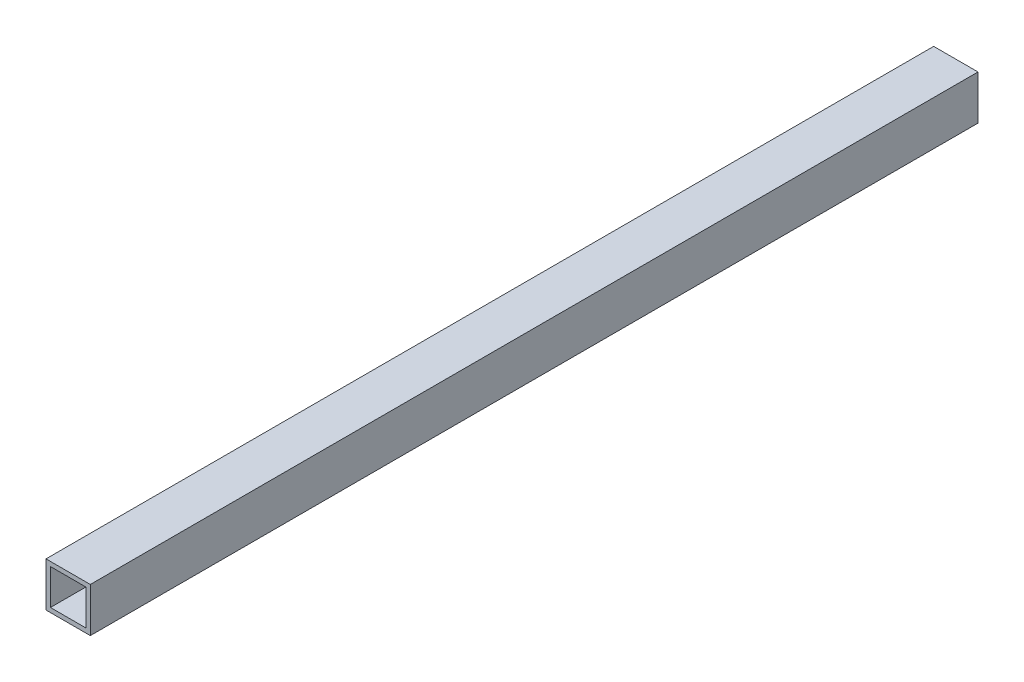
ISO-10303-21;
HEADER;
FILE_DESCRIPTION(('STEP AP214'),'2;1');
FILE_NAME('part.step','',(''),(''),'','','');
FILE_SCHEMA(('AUTOMOTIVE_DESIGN { 1 0 10303 214 1 1 1 1 }'));
ENDSEC;
DATA;
#1=APPLICATION_CONTEXT('core data for automotive mechanical design processes');
#2=APPLICATION_PROTOCOL_DEFINITION('international standard','automotive_design',2000,#1);
#3=PRODUCT_CONTEXT('',#1,'mechanical');
#4=PRODUCT('Part','Part','',(#3));
#5=PRODUCT_RELATED_PRODUCT_CATEGORY('part','',(#4));
#6=PRODUCT_DEFINITION_FORMATION('','',#4);
#7=PRODUCT_DEFINITION_CONTEXT('part definition',#1,'design');
#8=PRODUCT_DEFINITION('design','',#6,#7);
#9=PRODUCT_DEFINITION_SHAPE('','',#8);
#10=(LENGTH_UNIT() NAMED_UNIT(*) SI_UNIT(.MILLI.,.METRE.));
#11=(NAMED_UNIT(*) PLANE_ANGLE_UNIT() SI_UNIT($,.RADIAN.));
#12=(NAMED_UNIT(*) SI_UNIT($,.STERADIAN.) SOLID_ANGLE_UNIT());
#13=UNCERTAINTY_MEASURE_WITH_UNIT(LENGTH_MEASURE(1.E-05),#10,'distance_accuracy_value','');
#14=(GEOMETRIC_REPRESENTATION_CONTEXT(3) GLOBAL_UNCERTAINTY_ASSIGNED_CONTEXT((#13)) GLOBAL_UNIT_ASSIGNED_CONTEXT((#10,
#11,#12)) REPRESENTATION_CONTEXT('',''));
#15=CARTESIAN_POINT('',(0.,0.,0.));
#16=DIRECTION('',(0.,0.,1.));
#17=DIRECTION('',(1.,0.,0.));
#18=AXIS2_PLACEMENT_3D('',#15,#16,#17);
#19=CARTESIAN_POINT('',(0.,0.,200.25));
#20=DIRECTION('',(0.,0.,1.));
#21=DIRECTION('',(1.,0.,0.));
#22=AXIS2_PLACEMENT_3D('',#19,#20,#21);
#23=PLANE('',#22);
#24=DIRECTION('',(0.,-1.,0.));
#25=VECTOR('',#24,1.);
#26=CARTESIAN_POINT('',(-4.91938651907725,6.2171488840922,200.25));
#27=LINE('',#26,#25);
#28=CARTESIAN_POINT('',(-4.91938651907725,6.2171488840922,200.25));
#29=VERTEX_POINT('',#28);
#30=CARTESIAN_POINT('',(-4.91938651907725,-3.78285111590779,200.25));
#31=VERTEX_POINT('',#30);
#32=EDGE_CURVE('E135',#29,#31,#27,.T.);
#33=ORIENTED_EDGE('',*,*,#32,.T.);
#34=DIRECTION('',(1.,0.,0.));
#35=VECTOR('',#34,1.);
#36=CARTESIAN_POINT('',(-4.91938651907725,-3.78285111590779,200.25));
#37=LINE('',#36,#35);
#38=CARTESIAN_POINT('',(5.08061348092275,-3.78285111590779,200.25));
#39=VERTEX_POINT('',#38);
#40=EDGE_CURVE('E138',#31,#39,#37,.T.);
#41=ORIENTED_EDGE('',*,*,#40,.T.);
#42=DIRECTION('',(0.,1.,0.));
#43=VECTOR('',#42,1.);
#44=CARTESIAN_POINT('',(5.08061348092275,6.2171488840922,200.25));
#45=LINE('',#44,#43);
#46=CARTESIAN_POINT('',(5.08061348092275,6.2171488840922,200.25));
#47=VERTEX_POINT('',#46);
#48=EDGE_CURVE('E141',#39,#47,#45,.T.);
#49=ORIENTED_EDGE('',*,*,#48,.T.);
#50=DIRECTION('',(-1.,0.,0.));
#51=VECTOR('',#50,1.);
#52=CARTESIAN_POINT('',(-4.91938651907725,6.2171488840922,200.25));
#53=LINE('',#52,#51);
#54=EDGE_CURVE('E143',#47,#29,#53,.T.);
#55=ORIENTED_EDGE('',*,*,#54,.T.);
#56=EDGE_LOOP('',(#33,#41,#49,#55));
#57=FACE_BOUND('',#56,.T.);
#58=DIRECTION('',(1.,0.,0.));
#59=VECTOR('',#58,1.);
#60=CARTESIAN_POINT('',(4.08061348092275,-2.7828511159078,200.25));
#61=LINE('',#60,#59);
#62=CARTESIAN_POINT('',(-3.91938651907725,-2.7828511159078,200.25));
#63=VERTEX_POINT('',#62);
#64=CARTESIAN_POINT('',(4.08061348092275,-2.7828511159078,200.25));
#65=VERTEX_POINT('',#64);
#66=EDGE_CURVE('E107',#63,#65,#61,.T.);
#67=ORIENTED_EDGE('',*,*,#66,.F.);
#68=DIRECTION('',(0.,-1.,0.));
#69=VECTOR('',#68,1.);
#70=CARTESIAN_POINT('',(-3.91938651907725,-2.7828511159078,200.25));
#71=LINE('',#70,#69);
#72=CARTESIAN_POINT('',(-3.91938651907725,5.2171488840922,200.25));
#73=VERTEX_POINT('',#72);
#74=EDGE_CURVE('E99',#73,#63,#71,.T.);
#75=ORIENTED_EDGE('',*,*,#74,.F.);
#76=DIRECTION('',(-1.,0.,0.));
#77=VECTOR('',#76,1.);
#78=CARTESIAN_POINT('',(4.08061348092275,5.2171488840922,200.25));
#79=LINE('',#78,#77);
#80=CARTESIAN_POINT('',(4.08061348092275,5.2171488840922,200.25));
#81=VERTEX_POINT('',#80);
#82=EDGE_CURVE('E121',#81,#73,#79,.T.);
#83=ORIENTED_EDGE('',*,*,#82,.F.);
#84=DIRECTION('',(0.,1.,0.));
#85=VECTOR('',#84,1.);
#86=CARTESIAN_POINT('',(4.08061348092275,-2.7828511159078,200.25));
#87=LINE('',#86,#85);
#88=EDGE_CURVE('E119',#65,#81,#87,.T.);
#89=ORIENTED_EDGE('',*,*,#88,.F.);
#90=EDGE_LOOP('',(#67,#75,#83,#89));
#91=FACE_BOUND('',#90,.T.);
#92=ADVANCED_FACE('F34',(#57,#91),#23,.T.);
#93=CARTESIAN_POINT('',(0.,0.,0.));
#94=DIRECTION('',(0.,0.,1.));
#95=DIRECTION('',(1.,0.,0.));
#96=AXIS2_PLACEMENT_3D('',#93,#94,#95);
#97=PLANE('',#96);
#98=DIRECTION('',(0.,-1.,0.));
#99=VECTOR('',#98,1.);
#100=CARTESIAN_POINT('',(-4.91938651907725,6.2171488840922,0.));
#101=LINE('',#100,#99);
#102=CARTESIAN_POINT('',(-4.91938651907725,6.2171488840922,0.));
#103=VERTEX_POINT('',#102);
#104=CARTESIAN_POINT('',(-4.91938651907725,-3.78285111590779,0.));
#105=VERTEX_POINT('',#104);
#106=EDGE_CURVE('E115',#103,#105,#101,.T.);
#107=ORIENTED_EDGE('',*,*,#106,.F.);
#108=DIRECTION('',(-1.,0.,0.));
#109=VECTOR('',#108,1.);
#110=CARTESIAN_POINT('',(-4.91938651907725,6.2171488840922,0.));
#111=LINE('',#110,#109);
#112=CARTESIAN_POINT('',(5.08061348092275,6.2171488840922,0.));
#113=VERTEX_POINT('',#112);
#114=EDGE_CURVE('E139',#113,#103,#111,.T.);
#115=ORIENTED_EDGE('',*,*,#114,.F.);
#116=DIRECTION('',(0.,1.,0.));
#117=VECTOR('',#116,1.);
#118=CARTESIAN_POINT('',(5.08061348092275,6.2171488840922,0.));
#119=LINE('',#118,#117);
#120=CARTESIAN_POINT('',(5.08061348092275,-3.78285111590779,0.));
#121=VERTEX_POINT('',#120);
#122=EDGE_CURVE('E150',#121,#113,#119,.T.);
#123=ORIENTED_EDGE('',*,*,#122,.F.);
#124=DIRECTION('',(1.,0.,0.));
#125=VECTOR('',#124,1.);
#126=CARTESIAN_POINT('',(-4.91938651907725,-3.78285111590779,0.));
#127=LINE('',#126,#125);
#128=EDGE_CURVE('E148',#105,#121,#127,.T.);
#129=ORIENTED_EDGE('',*,*,#128,.F.);
#130=EDGE_LOOP('',(#107,#115,#123,#129));
#131=FACE_BOUND('',#130,.T.);
#132=DIRECTION('',(0.,-1.,0.));
#133=VECTOR('',#132,1.);
#134=CARTESIAN_POINT('',(-3.91938651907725,-2.7828511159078,0.));
#135=LINE('',#134,#133);
#136=CARTESIAN_POINT('',(-3.91938651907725,5.2171488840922,0.));
#137=VERTEX_POINT('',#136);
#138=CARTESIAN_POINT('',(-3.91938651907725,-2.7828511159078,0.));
#139=VERTEX_POINT('',#138);
#140=EDGE_CURVE('E57',#137,#139,#135,.T.);
#141=ORIENTED_EDGE('',*,*,#140,.T.);
#142=DIRECTION('',(1.,0.,0.));
#143=VECTOR('',#142,1.);
#144=CARTESIAN_POINT('',(4.08061348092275,-2.7828511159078,0.));
#145=LINE('',#144,#143);
#146=CARTESIAN_POINT('',(4.08061348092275,-2.7828511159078,0.));
#147=VERTEX_POINT('',#146);
#148=EDGE_CURVE('E114',#139,#147,#145,.T.);
#149=ORIENTED_EDGE('',*,*,#148,.T.);
#150=DIRECTION('',(0.,1.,0.));
#151=VECTOR('',#150,1.);
#152=CARTESIAN_POINT('',(4.08061348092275,-2.7828511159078,0.));
#153=LINE('',#152,#151);
#154=CARTESIAN_POINT('',(4.08061348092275,5.2171488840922,0.));
#155=VERTEX_POINT('',#154);
#156=EDGE_CURVE('E127',#147,#155,#153,.T.);
#157=ORIENTED_EDGE('',*,*,#156,.T.);
#158=DIRECTION('',(-1.,0.,0.));
#159=VECTOR('',#158,1.);
#160=CARTESIAN_POINT('',(4.08061348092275,5.2171488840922,0.));
#161=LINE('',#160,#159);
#162=EDGE_CURVE('E108',#155,#137,#161,.T.);
#163=ORIENTED_EDGE('',*,*,#162,.T.);
#164=EDGE_LOOP('',(#141,#149,#157,#163));
#165=FACE_BOUND('',#164,.T.);
#166=ADVANCED_FACE('F168',(#131,#165),#97,.F.);
#167=CARTESIAN_POINT('',(-4.91938651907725,6.2171488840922,200.25));
#168=DIRECTION('',(1.,0.,0.));
#169=DIRECTION('',(0.,1.,0.));
#170=AXIS2_PLACEMENT_3D('',#167,#168,#169);
#171=PLANE('',#170);
#172=ORIENTED_EDGE('',*,*,#106,.T.);
#173=DIRECTION('',(0.,0.,-1.));
#174=VECTOR('',#173,1.);
#175=CARTESIAN_POINT('',(-4.91938651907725,-3.78285111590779,200.25));
#176=LINE('',#175,#174);
#177=EDGE_CURVE('E11',#31,#105,#176,.T.);
#178=ORIENTED_EDGE('',*,*,#177,.F.);
#179=ORIENTED_EDGE('',*,*,#32,.F.);
#180=DIRECTION('',(0.,0.,-1.));
#181=VECTOR('',#180,1.);
#182=CARTESIAN_POINT('',(-4.91938651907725,6.2171488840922,200.25));
#183=LINE('',#182,#181);
#184=EDGE_CURVE('E145',#29,#103,#183,.T.);
#185=ORIENTED_EDGE('',*,*,#184,.T.);
#186=EDGE_LOOP('',(#172,#178,#179,#185));
#187=FACE_BOUND('',#186,.T.);
#188=ADVANCED_FACE('F36',(#187),#171,.F.);
#189=CARTESIAN_POINT('',(-4.91938651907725,-3.78285111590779,200.25));
#190=DIRECTION('',(0.,1.,0.));
#191=DIRECTION('',(0.,0.,1.));
#192=AXIS2_PLACEMENT_3D('',#189,#190,#191);
#193=PLANE('',#192);
#194=ORIENTED_EDGE('',*,*,#128,.T.);
#195=DIRECTION('',(0.,0.,-1.));
#196=VECTOR('',#195,1.);
#197=CARTESIAN_POINT('',(5.08061348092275,-3.78285111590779,200.25));
#198=LINE('',#197,#196);
#199=EDGE_CURVE('E42',#39,#121,#198,.T.);
#200=ORIENTED_EDGE('',*,*,#199,.F.);
#201=ORIENTED_EDGE('',*,*,#40,.F.);
#202=ORIENTED_EDGE('',*,*,#177,.T.);
#203=EDGE_LOOP('',(#194,#200,#201,#202));
#204=FACE_BOUND('',#203,.T.);
#205=ADVANCED_FACE('F178',(#204),#193,.F.);
#206=CARTESIAN_POINT('',(5.08061348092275,6.2171488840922,200.25));
#207=DIRECTION('',(-1.,0.,0.));
#208=DIRECTION('',(0.,-1.,0.));
#209=AXIS2_PLACEMENT_3D('',#206,#207,#208);
#210=PLANE('',#209);
#211=ORIENTED_EDGE('',*,*,#122,.T.);
#212=DIRECTION('',(0.,0.,-1.));
#213=VECTOR('',#212,1.);
#214=CARTESIAN_POINT('',(5.08061348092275,6.2171488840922,200.25));
#215=LINE('',#214,#213);
#216=EDGE_CURVE('E155',#47,#113,#215,.T.);
#217=ORIENTED_EDGE('',*,*,#216,.F.);
#218=ORIENTED_EDGE('',*,*,#48,.F.);
#219=ORIENTED_EDGE('',*,*,#199,.T.);
#220=EDGE_LOOP('',(#211,#217,#218,#219));
#221=FACE_BOUND('',#220,.T.);
#222=ADVANCED_FACE('F162',(#221),#210,.F.);
#223=CARTESIAN_POINT('',(-4.91938651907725,6.2171488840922,200.25));
#224=DIRECTION('',(0.,-1.,0.));
#225=DIRECTION('',(0.,0.,-1.));
#226=AXIS2_PLACEMENT_3D('',#223,#224,#225);
#227=PLANE('',#226);
#228=ORIENTED_EDGE('',*,*,#114,.T.);
#229=ORIENTED_EDGE('',*,*,#184,.F.);
#230=ORIENTED_EDGE('',*,*,#54,.F.);
#231=ORIENTED_EDGE('',*,*,#216,.T.);
#232=EDGE_LOOP('',(#228,#229,#230,#231));
#233=FACE_BOUND('',#232,.T.);
#234=ADVANCED_FACE('F172',(#233),#227,.F.);
#235=CARTESIAN_POINT('',(-3.91938651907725,-2.7828511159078,200.25));
#236=DIRECTION('',(1.,0.,0.));
#237=DIRECTION('',(0.,0.,-1.));
#238=AXIS2_PLACEMENT_3D('',#235,#236,#237);
#239=PLANE('',#238);
#240=ORIENTED_EDGE('',*,*,#140,.F.);
#241=DIRECTION('',(0.,0.,-1.));
#242=VECTOR('',#241,1.);
#243=CARTESIAN_POINT('',(-3.91938651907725,5.2171488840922,200.25));
#244=LINE('',#243,#242);
#245=EDGE_CURVE('E103',#73,#137,#244,.T.);
#246=ORIENTED_EDGE('',*,*,#245,.F.);
#247=ORIENTED_EDGE('',*,*,#74,.T.);
#248=DIRECTION('',(0.,0.,-1.));
#249=VECTOR('',#248,1.);
#250=CARTESIAN_POINT('',(-3.91938651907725,-2.7828511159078,200.25));
#251=LINE('',#250,#249);
#252=EDGE_CURVE('E102',#63,#139,#251,.T.);
#253=ORIENTED_EDGE('',*,*,#252,.T.);
#254=EDGE_LOOP('',(#240,#246,#247,#253));
#255=FACE_BOUND('',#254,.T.);
#256=ADVANCED_FACE('F101',(#255),#239,.T.);
#257=CARTESIAN_POINT('',(4.08061348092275,-2.7828511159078,200.25));
#258=DIRECTION('',(0.,1.,0.));
#259=DIRECTION('',(0.,0.,1.));
#260=AXIS2_PLACEMENT_3D('',#257,#258,#259);
#261=PLANE('',#260);
#262=ORIENTED_EDGE('',*,*,#148,.F.);
#263=ORIENTED_EDGE('',*,*,#252,.F.);
#264=ORIENTED_EDGE('',*,*,#66,.T.);
#265=DIRECTION('',(0.,0.,-1.));
#266=VECTOR('',#265,1.);
#267=CARTESIAN_POINT('',(4.08061348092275,-2.7828511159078,200.25));
#268=LINE('',#267,#266);
#269=EDGE_CURVE('E116',#65,#147,#268,.T.);
#270=ORIENTED_EDGE('',*,*,#269,.T.);
#271=EDGE_LOOP('',(#262,#263,#264,#270));
#272=FACE_BOUND('',#271,.T.);
#273=ADVANCED_FACE('F111',(#272),#261,.T.);
#274=CARTESIAN_POINT('',(4.08061348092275,-2.7828511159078,200.25));
#275=DIRECTION('',(-1.,0.,0.));
#276=DIRECTION('',(0.,0.,1.));
#277=AXIS2_PLACEMENT_3D('',#274,#275,#276);
#278=PLANE('',#277);
#279=ORIENTED_EDGE('',*,*,#156,.F.);
#280=ORIENTED_EDGE('',*,*,#269,.F.);
#281=ORIENTED_EDGE('',*,*,#88,.T.);
#282=DIRECTION('',(0.,0.,-1.));
#283=VECTOR('',#282,1.);
#284=CARTESIAN_POINT('',(4.08061348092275,5.2171488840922,200.25));
#285=LINE('',#284,#283);
#286=EDGE_CURVE('E49',#81,#155,#285,.T.);
#287=ORIENTED_EDGE('',*,*,#286,.T.);
#288=EDGE_LOOP('',(#279,#280,#281,#287));
#289=FACE_BOUND('',#288,.T.);
#290=ADVANCED_FACE('F201',(#289),#278,.T.);
#291=CARTESIAN_POINT('',(4.08061348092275,5.2171488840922,200.25));
#292=DIRECTION('',(0.,-1.,0.));
#293=DIRECTION('',(0.,0.,-1.));
#294=AXIS2_PLACEMENT_3D('',#291,#292,#293);
#295=PLANE('',#294);
#296=ORIENTED_EDGE('',*,*,#162,.F.);
#297=ORIENTED_EDGE('',*,*,#286,.F.);
#298=ORIENTED_EDGE('',*,*,#82,.T.);
#299=ORIENTED_EDGE('',*,*,#245,.T.);
#300=EDGE_LOOP('',(#296,#297,#298,#299));
#301=FACE_BOUND('',#300,.T.);
#302=ADVANCED_FACE('F205',(#301),#295,.T.);
#303=CLOSED_SHELL('',(#92,#166,#188,#205,#222,#234,#256,#273,#290,#302));
#304=MANIFOLD_SOLID_BREP('B2',#303);
#305=ADVANCED_BREP_SHAPE_REPRESENTATION('',(#18,#304),#14);
#306=SHAPE_DEFINITION_REPRESENTATION(#9,#305);
ENDSEC;
END-ISO-10303-21;
